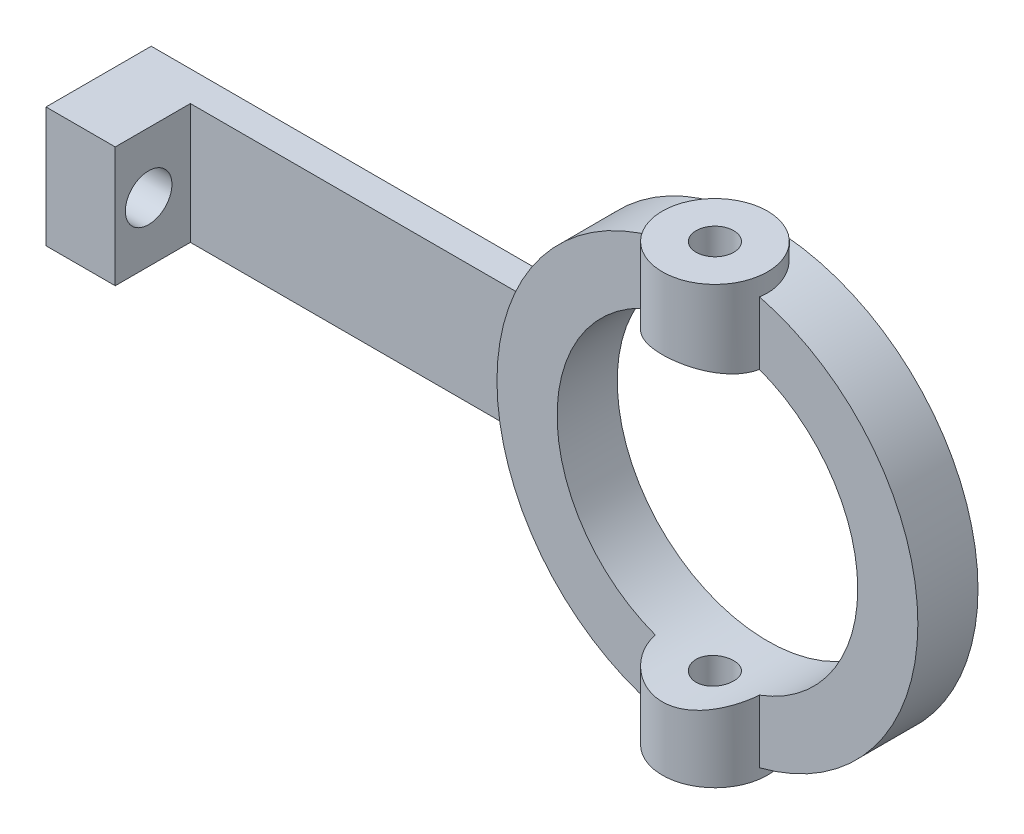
ISO-10303-21;
HEADER;
FILE_DESCRIPTION(('STEP AP214'),'2;1');
FILE_NAME('part.step','',(''),(''),'','','');
FILE_SCHEMA(('AUTOMOTIVE_DESIGN { 1 0 10303 214 1 1 1 1 }'));
ENDSEC;
DATA;
#1=APPLICATION_CONTEXT('core data for automotive mechanical design processes');
#2=APPLICATION_PROTOCOL_DEFINITION('international standard','automotive_design',2000,#1);
#3=PRODUCT_CONTEXT('',#1,'mechanical');
#4=PRODUCT('Part','Part','',(#3));
#5=PRODUCT_RELATED_PRODUCT_CATEGORY('part','',(#4));
#6=PRODUCT_DEFINITION_FORMATION('','',#4);
#7=PRODUCT_DEFINITION_CONTEXT('part definition',#1,'design');
#8=PRODUCT_DEFINITION('design','',#6,#7);
#9=PRODUCT_DEFINITION_SHAPE('','',#8);
#10=(LENGTH_UNIT() NAMED_UNIT(*) SI_UNIT(.MILLI.,.METRE.));
#11=(NAMED_UNIT(*) PLANE_ANGLE_UNIT() SI_UNIT($,.RADIAN.));
#12=(NAMED_UNIT(*) SI_UNIT($,.STERADIAN.) SOLID_ANGLE_UNIT());
#13=UNCERTAINTY_MEASURE_WITH_UNIT(LENGTH_MEASURE(1.E-05),#10,'distance_accuracy_value','');
#14=(GEOMETRIC_REPRESENTATION_CONTEXT(3) GLOBAL_UNCERTAINTY_ASSIGNED_CONTEXT((#13)) GLOBAL_UNIT_ASSIGNED_CONTEXT((#10,
#11,#12)) REPRESENTATION_CONTEXT('',''));
#15=CARTESIAN_POINT('',(0.,0.,0.));
#16=DIRECTION('',(0.,0.,1.));
#17=DIRECTION('',(1.,0.,0.));
#18=AXIS2_PLACEMENT_3D('',#15,#16,#17);
#19=CARTESIAN_POINT('',(0.,0.,2.));
#20=DIRECTION('',(0.,0.,1.));
#21=DIRECTION('',(1.,0.,0.));
#22=AXIS2_PLACEMENT_3D('',#19,#20,#21);
#23=PLANE('',#22);
#24=DIRECTION('',(-1.,0.,0.));
#25=VECTOR('',#24,1.);
#26=CARTESIAN_POINT('',(-359.861083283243,48.695652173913,2.));
#27=LINE('',#26,#25);
#28=CARTESIAN_POINT('',(-332.343049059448,48.695652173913,2.));
#29=VERTEX_POINT('',#28);
#30=CARTESIAN_POINT('',(-355.255582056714,48.695652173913,2.));
#31=VERTEX_POINT('',#30);
#32=EDGE_CURVE('E55',#29,#31,#27,.T.);
#33=ORIENTED_EDGE('',*,*,#32,.T.);
#34=DIRECTION('',(0.,1.,0.));
#35=VECTOR('',#34,1.);
#36=CARTESIAN_POINT('',(-355.255582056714,48.695652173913,2.));
#37=LINE('',#36,#35);
#38=CARTESIAN_POINT('',(-355.255582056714,40.695652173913,2.));
#39=VERTEX_POINT('',#38);
#40=EDGE_CURVE('E50',#39,#31,#37,.T.);
#41=ORIENTED_EDGE('',*,*,#40,.F.);
#42=DIRECTION('',(1.,0.,0.));
#43=VECTOR('',#42,1.);
#44=CARTESIAN_POINT('',(-359.861083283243,40.695652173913,2.));
#45=LINE('',#44,#43);
#46=CARTESIAN_POINT('',(-332.207755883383,40.695652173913,2.));
#47=VERTEX_POINT('',#46);
#48=EDGE_CURVE('E452',#39,#47,#45,.T.);
#49=ORIENTED_EDGE('',*,*,#48,.T.);
#50=CARTESIAN_POINT('',(-318.861083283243,44.9225104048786,2.));
#51=DIRECTION('',(0.,0.,1.));
#52=DIRECTION('',(1.,0.,0.));
#53=AXIS2_PLACEMENT_3D('',#50,#51,#52);
#54=CIRCLE('',#53,14.);
#55=EDGE_CURVE('E462',#29,#47,#54,.T.);
#56=ORIENTED_EDGE('',*,*,#55,.F.);
#57=EDGE_LOOP('',(#33,#41,#49,#56));
#58=FACE_BOUND('',#57,.T.);
#59=ADVANCED_FACE('F33',(#58),#23,.T.);
#60=CARTESIAN_POINT('',(-318.861083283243,59.695652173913,3.5));
#61=DIRECTION('',(0.,-1.,0.));
#62=DIRECTION('',(0.,0.,-1.));
#63=AXIS2_PLACEMENT_3D('',#60,#61,#62);
#64=CYLINDRICAL_SURFACE('',#63,3.50000000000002);
#65=CARTESIAN_POINT('',(-318.861083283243,34.9225104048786,0.));
#66=CARTESIAN_POINT('',(-319.051502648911,34.9225083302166,-2.95664941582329E-06));
#67=CARTESIAN_POINT('',(-319.241900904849,34.9279984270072,0.0155896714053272));
#68=CARTESIAN_POINT('',(-319.617056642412,34.9493558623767,0.0773337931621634));
#69=CARTESIAN_POINT('',(-319.801814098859,34.9652232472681,0.123485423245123));
#70=CARTESIAN_POINT('',(-320.160225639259,35.005619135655,0.244548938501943));
#71=CARTESIAN_POINT('',(-320.333898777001,35.0301322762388,0.31940982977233));
#72=CARTESIAN_POINT('',(-320.666219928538,35.0853414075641,0.495525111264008));
#73=CARTESIAN_POINT('',(-320.824864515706,35.1160388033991,0.596785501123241));
#74=CARTESIAN_POINT('',(-321.128609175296,35.1817042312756,0.826828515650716));
#75=CARTESIAN_POINT('',(-321.273065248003,35.2167819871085,0.956429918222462));
#76=CARTESIAN_POINT('',(-321.538695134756,35.2866764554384,1.23773666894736));
#77=CARTESIAN_POINT('',(-321.659863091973,35.3214931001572,1.38944756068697));
#78=CARTESIAN_POINT('',(-321.879312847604,35.3881568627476,1.71665464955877));
#79=CARTESIAN_POINT('',(-321.976729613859,35.4198718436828,1.89276055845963));
#80=CARTESIAN_POINT('',(-322.140282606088,35.475057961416,2.26014459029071));
#81=CARTESIAN_POINT('',(-322.20642950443,35.4985319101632,2.45141751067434));
#82=CARTESIAN_POINT('',(-322.303099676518,35.5334160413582,2.83634303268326));
#83=CARTESIAN_POINT('',(-322.334838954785,35.5452365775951,3.02965189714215));
#84=CARTESIAN_POINT('',(-322.365595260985,35.5566846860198,3.4191851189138));
#85=CARTESIAN_POINT('',(-322.364623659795,35.5563164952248,3.61540843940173));
#86=CARTESIAN_POINT('',(-322.330924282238,35.5437861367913,3.99454945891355));
#87=CARTESIAN_POINT('',(-322.299820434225,35.5322271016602,4.1776349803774));
#88=CARTESIAN_POINT('',(-322.209402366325,35.4996103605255,4.53580240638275));
#89=CARTESIAN_POINT('',(-322.15008444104,35.4785514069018,4.7108832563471));
#90=CARTESIAN_POINT('',(-322.003926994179,35.428904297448,5.05161236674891));
#91=CARTESIAN_POINT('',(-321.91662993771,35.4001924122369,5.21704555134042));
#92=CARTESIAN_POINT('',(-321.71731016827,35.3385222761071,5.53141194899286));
#93=CARTESIAN_POINT('',(-321.605279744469,35.3055627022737,5.68033999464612));
#94=CARTESIAN_POINT('',(-321.35201727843,35.2367779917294,5.9665432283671));
#95=CARTESIAN_POINT('',(-321.209469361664,35.2008974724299,6.10264324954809));
#96=CARTESIAN_POINT('',(-320.903140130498,35.1319729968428,6.34932987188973));
#97=CARTESIAN_POINT('',(-320.739356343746,35.0989293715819,6.45991349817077));
#98=CARTESIAN_POINT('',(-320.392518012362,35.0388872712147,6.65350599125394));
#99=CARTESIAN_POINT('',(-320.209257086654,35.0119655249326,6.73617056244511));
#100=CARTESIAN_POINT('',(-319.830258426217,34.9677615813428,6.86912230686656));
#101=CARTESIAN_POINT('',(-319.63452552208,34.9504756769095,6.91942193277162));
#102=CARTESIAN_POINT('',(-319.246065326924,34.9281198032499,6.98406581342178));
#103=CARTESIAN_POINT('',(-319.05363258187,34.9225115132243,6.99999580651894));
#104=CARTESIAN_POINT('',(-318.668786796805,34.9225092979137,7.00000418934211));
#105=CARTESIAN_POINT('',(-318.476373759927,34.9281132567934,6.98408858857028));
#106=CARTESIAN_POINT('',(-318.10357098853,34.9495500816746,6.92209465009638));
#107=CARTESIAN_POINT('',(-317.922993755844,34.9650440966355,6.87701486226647));
#108=CARTESIAN_POINT('',(-317.572058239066,35.0043645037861,6.75924618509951));
#109=CARTESIAN_POINT('',(-317.401701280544,35.0281919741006,6.68655372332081));
#110=CARTESIAN_POINT('',(-317.070776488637,35.0826061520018,6.51340991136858));
#111=CARTESIAN_POINT('',(-316.910610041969,35.1133616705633,6.41224601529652));
#112=CARTESIAN_POINT('',(-316.609025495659,35.1781752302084,6.18585482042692));
#113=CARTESIAN_POINT('',(-316.467613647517,35.2122343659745,6.06061953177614));
#114=CARTESIAN_POINT('',(-316.200130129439,35.2820020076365,5.782199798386));
#115=CARTESIAN_POINT('',(-316.075188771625,35.3177072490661,5.62792589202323));
#116=CARTESIAN_POINT('',(-315.852795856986,35.3850186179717,5.29985410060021));
#117=CARTESIAN_POINT('',(-315.75534526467,35.4166246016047,5.12605553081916));
#118=CARTESIAN_POINT('',(-315.590973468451,35.4719048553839,4.76333270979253));
#119=CARTESIAN_POINT('',(-315.524052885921,35.495578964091,4.57440815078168));
#120=CARTESIAN_POINT('',(-315.423331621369,35.5318349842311,4.18693454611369));
#121=CARTESIAN_POINT('',(-315.389513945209,35.5444225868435,3.98839049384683));
#122=CARTESIAN_POINT('',(-315.357363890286,35.5563897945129,3.59937967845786));
#123=CARTESIAN_POINT('',(-315.357135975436,35.5564749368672,3.40908970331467));
#124=CARTESIAN_POINT('',(-315.387432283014,35.5451971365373,3.03133737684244));
#125=CARTESIAN_POINT('',(-315.417954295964,35.5338350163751,2.84387482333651));
#126=CARTESIAN_POINT('',(-315.507486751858,35.5014934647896,2.4814490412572));
#127=CARTESIAN_POINT('',(-315.565822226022,35.4807424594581,2.30629703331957));
#128=CARTESIAN_POINT('',(-315.708762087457,35.432065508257,1.96814190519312));
#129=CARTESIAN_POINT('',(-315.79337265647,35.4041378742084,1.80514165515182));
#130=CARTESIAN_POINT('',(-315.991113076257,35.3426116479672,1.48756542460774));
#131=CARTESIAN_POINT('',(-316.105400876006,35.3088075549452,1.33375059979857));
#132=CARTESIAN_POINT('',(-316.357359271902,35.2401347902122,1.04687237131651));
#133=CARTESIAN_POINT('',(-316.495036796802,35.2052658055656,0.913815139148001));
#134=CARTESIAN_POINT('',(-316.797230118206,35.1365237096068,0.666216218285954));
#135=CARTESIAN_POINT('',(-316.962669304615,35.1027644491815,0.552765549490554));
#136=CARTESIAN_POINT('',(-317.31141565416,35.0417301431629,0.355376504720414));
#137=CARTESIAN_POINT('',(-317.494720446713,35.0144542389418,0.27143422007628));
#138=CARTESIAN_POINT('',(-317.872053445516,34.9697475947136,0.136742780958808));
#139=CARTESIAN_POINT('',(-318.06594373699,34.952213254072,0.0856433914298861));
#140=CARTESIAN_POINT('',(-318.460259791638,34.9285977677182,0.017279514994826));
#141=CARTESIAN_POINT('',(-318.660683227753,34.9225125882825,3.11161996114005E-06));
#142=CARTESIAN_POINT('',(-318.861083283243,34.9225104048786,0.));
#143=B_SPLINE_CURVE_WITH_KNOTS('',3,(#65,#66,#67,#68,#69,#70,#71,#72,#73,#74,#75,#76,#77,#78,
#79,#80,#81,#82,#83,#84,#85,#86,#87,#88,#89,#90,#91,#92,#93,#94,#95,#96,#97,#98,#99,#100,#101,
#102,#103,#104,#105,#106,#107,#108,#109,#110,#111,#112,#113,#114,#115,#116,#117,#118,#119,#120,
#121,#122,#123,#124,#125,#126,#127,#128,#129,#130,#131,#132,#133,#134,#135,#136,#137,#138,#139,
#140,#141,#142),.UNSPECIFIED.,.T.,.F.,(4,2,2,2,2,2,2,2,2,2,2,2,2,2,2,2,2,2,2,2,2,2,2,2,2,2,2,2,
2,2,2,2,2,2,2,2,2,2,4),(0.,0.570519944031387,1.14104243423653,1.71055621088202,2.28019953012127,
2.86921290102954,3.45837421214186,4.06655384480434,4.67452575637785,5.26023033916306,
5.84573132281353,6.40133800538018,6.95701767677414,7.52229238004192,8.08774356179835,
8.68595781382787,9.28424177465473,9.88965514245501,10.4948354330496,11.071437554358,
11.6479308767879,12.2056613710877,12.7634640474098,13.3367037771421,13.9101341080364,
14.5124257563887,15.1147385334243,15.7170635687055,16.319079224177,16.8871081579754,
17.4550962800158,18.0099524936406,18.5649393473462,19.1461307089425,19.7274945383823,
20.3347978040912,20.942020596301,21.5426555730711,22.1430788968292),.UNSPECIFIED.);
#144=CARTESIAN_POINT('',(-322.325184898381,35.5416788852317,4.00000000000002));
#145=VERTEX_POINT('',#144);
#146=CARTESIAN_POINT('',(-315.396981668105,35.5416788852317,4.00000000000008));
#147=VERTEX_POINT('',#146);
#148=EDGE_CURVE('E42',#145,#147,#143,.T.);
#149=ORIENTED_EDGE('',*,*,#148,.F.);
#150=DIRECTION('',(0.,-1.,0.));
#151=VECTOR('',#150,1.);
#152=CARTESIAN_POINT('',(-322.325184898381,59.695652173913,4.));
#153=LINE('',#152,#151);
#154=CARTESIAN_POINT('',(-322.325184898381,31.357850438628,4.));
#155=VERTEX_POINT('',#154);
#156=EDGE_CURVE('E446',#155,#145,#153,.F.);
#157=ORIENTED_EDGE('',*,*,#156,.F.);
#158=CARTESIAN_POINT('',(-318.861083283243,30.9225104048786,0.));
#159=CARTESIAN_POINT('',(-318.667705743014,30.9225136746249,5.42672235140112E-06));
#160=CARTESIAN_POINT('',(-318.474267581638,30.9265569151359,0.0160802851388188));
#161=CARTESIAN_POINT('',(-318.092935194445,30.9422944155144,0.0798586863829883));
#162=CARTESIAN_POINT('',(-317.905044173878,30.9539930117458,0.12758015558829));
#163=CARTESIAN_POINT('',(-317.540367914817,30.9837457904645,0.253024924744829));
#164=CARTESIAN_POINT('',(-317.36356963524,31.0017923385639,0.330712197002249));
#165=CARTESIAN_POINT('',(-317.025514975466,31.0423190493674,0.513756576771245));
#166=CARTESIAN_POINT('',(-316.864259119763,31.0647993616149,0.619114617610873));
#167=CARTESIAN_POINT('',(-316.558545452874,31.1122707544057,0.856801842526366));
#168=CARTESIAN_POINT('',(-316.414453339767,31.1373005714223,0.989593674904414));
#169=CARTESIAN_POINT('',(-316.150335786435,31.1867926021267,1.27738847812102));
#170=CARTESIAN_POINT('',(-316.030313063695,31.2112547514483,1.4323939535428));
#171=CARTESIAN_POINT('',(-315.816021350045,31.2572323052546,1.76305552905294));
#172=CARTESIAN_POINT('',(-315.722161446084,31.278698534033,1.93898420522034));
#173=CARTESIAN_POINT('',(-315.565490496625,31.3156888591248,2.30474629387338));
#174=CARTESIAN_POINT('',(-315.502674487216,31.3312139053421,2.49457747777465));
#175=CARTESIAN_POINT('',(-315.411121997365,31.354165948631,2.87873482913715));
#176=CARTESIAN_POINT('',(-315.381727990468,31.3617489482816,3.07289475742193));
#177=CARTESIAN_POINT('',(-315.355805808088,31.3684252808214,3.46352666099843));
#178=CARTESIAN_POINT('',(-315.359272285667,31.3675199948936,3.65999825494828));
#179=CARTESIAN_POINT('',(-315.398448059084,31.3574622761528,4.04463688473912));
#180=CARTESIAN_POINT('',(-315.433373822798,31.3485102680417,4.23288978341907));
#181=CARTESIAN_POINT('',(-315.533226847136,31.3236871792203,4.6007757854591));
#182=CARTESIAN_POINT('',(-315.598156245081,31.3078156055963,4.78040827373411));
#183=CARTESIAN_POINT('',(-315.756841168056,31.2707577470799,5.12805537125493));
#184=CARTESIAN_POINT('',(-315.8508810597,31.2495194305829,5.2959344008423));
#185=CARTESIAN_POINT('',(-316.064918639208,31.2041504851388,5.61381032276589));
#186=CARTESIAN_POINT('',(-316.184920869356,31.1800193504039,5.76380407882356));
#187=CARTESIAN_POINT('',(-316.45153529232,31.1307398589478,6.0461417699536));
#188=CARTESIAN_POINT('',(-316.598808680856,31.1055821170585,6.17786047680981));
#189=CARTESIAN_POINT('',(-316.913655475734,31.0577045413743,6.41484956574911));
#190=CARTESIAN_POINT('',(-317.081229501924,31.0349847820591,6.52011913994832));
#191=CARTESIAN_POINT('',(-317.43281287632,30.9944299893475,6.7014513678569));
#192=CARTESIAN_POINT('',(-317.61687669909,30.9766120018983,6.77741246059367));
#193=CARTESIAN_POINT('',(-317.99570593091,30.9479923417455,6.89714037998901));
#194=CARTESIAN_POINT('',(-318.190469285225,30.937189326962,6.94091336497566));
#195=CARTESIAN_POINT('',(-318.579823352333,30.9240154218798,6.99406765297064));
#196=CARTESIAN_POINT('',(-318.774290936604,30.9214358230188,7.00430039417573));
#197=CARTESIAN_POINT('',(-319.162159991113,30.924404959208,6.99241899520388));
#198=CARTESIAN_POINT('',(-319.355561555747,30.9299529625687,6.97030776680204));
#199=CARTESIAN_POINT('',(-319.732849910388,30.9484201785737,6.89506788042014));
#200=CARTESIAN_POINT('',(-319.916835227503,30.9612289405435,6.84240371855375));
#201=CARTESIAN_POINT('',(-320.273350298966,30.9927739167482,6.70808347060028));
#202=CARTESIAN_POINT('',(-320.445878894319,31.0115107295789,6.62642445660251));
#203=CARTESIAN_POINT('',(-320.777970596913,31.0533332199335,6.43478236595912));
#204=CARTESIAN_POINT('',(-320.937249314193,31.076490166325,6.32432240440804));
#205=CARTESIAN_POINT('',(-321.235312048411,31.1244718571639,6.07882354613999));
#206=CARTESIAN_POINT('',(-321.374092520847,31.1492968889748,5.94378040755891));
#207=CARTESIAN_POINT('',(-321.630727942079,31.1985680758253,5.64899542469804));
#208=CARTESIAN_POINT('',(-321.747985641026,31.2229899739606,5.48872869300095));
#209=CARTESIAN_POINT('',(-321.953941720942,31.2680099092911,5.1502905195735));
#210=CARTESIAN_POINT('',(-322.04264136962,31.288608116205,4.97211987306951));
#211=CARTESIAN_POINT('',(-322.18830326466,31.3234215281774,4.60388664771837));
#212=CARTESIAN_POINT('',(-322.245453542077,31.3376744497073,4.41390220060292));
#213=CARTESIAN_POINT('',(-322.32688982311,31.3582197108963,4.02661084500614));
#214=CARTESIAN_POINT('',(-322.351183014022,31.3645137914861,3.82930554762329));
#215=CARTESIAN_POINT('',(-322.365839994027,31.3682960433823,3.43905094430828));
#216=CARTESIAN_POINT('',(-322.357158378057,31.3660319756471,3.2461393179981));
#217=CARTESIAN_POINT('',(-322.308296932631,31.3535258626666,2.86462425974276));
#218=CARTESIAN_POINT('',(-322.268117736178,31.3432839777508,2.67602074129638));
#219=CARTESIAN_POINT('',(-322.157923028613,31.3161143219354,2.30951359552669));
#220=CARTESIAN_POINT('',(-322.088086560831,31.2992267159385,2.13155295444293));
#221=CARTESIAN_POINT('',(-321.920701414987,31.2606627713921,1.78974744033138));
#222=CARTESIAN_POINT('',(-321.823148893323,31.2389857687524,1.62590452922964));
#223=CARTESIAN_POINT('',(-321.600108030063,31.1925789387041,1.31237253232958));
#224=CARTESIAN_POINT('',(-321.473957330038,31.167784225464,1.16316416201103));
#225=CARTESIAN_POINT('',(-321.198591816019,31.1183231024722,0.887723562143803));
#226=CARTESIAN_POINT('',(-321.049371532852,31.0936567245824,0.761496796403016));
#227=CARTESIAN_POINT('',(-320.728840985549,31.0466984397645,0.533373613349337));
#228=CARTESIAN_POINT('',(-320.557179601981,31.0244576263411,0.43195923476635));
#229=CARTESIAN_POINT('',(-320.198704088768,30.985395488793,0.259589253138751));
#230=CARTESIAN_POINT('',(-320.011900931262,30.9685702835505,0.18861182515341));
#231=CARTESIAN_POINT('',(-319.664707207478,30.9447223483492,0.0896657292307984));
#232=CARTESIAN_POINT('',(-319.505970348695,30.9364500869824,0.0561137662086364));
#233=CARTESIAN_POINT('',(-319.185197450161,30.9253429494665,0.0112794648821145));
#234=CARTESIAN_POINT('',(-319.023161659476,30.9225076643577,-4.54837905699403E-06));
#235=CARTESIAN_POINT('',(-318.861083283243,30.9225104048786,0.));
#236=B_SPLINE_CURVE_WITH_KNOTS('',3,(#158,#159,#160,#161,#162,#163,#164,#165,#166,#167,#168,
#169,#170,#171,#172,#173,#174,#175,#176,#177,#178,#179,#180,#181,#182,#183,#184,#185,#186,#187,
#188,#189,#190,#191,#192,#193,#194,#195,#196,#197,#198,#199,#200,#201,#202,#203,#204,#205,#206,
#207,#208,#209,#210,#211,#212,#213,#214,#215,#216,#217,#218,#219,#220,#221,#222,#223,#224,#225,
#226,#227,#228,#229,#230,#231,#232,#233,#234,#235),.UNSPECIFIED.,.T.,.F.,(4,2,2,2,2,2,2,2,2,2,2,
2,2,2,2,2,2,2,2,2,2,2,2,2,2,2,2,2,2,2,2,2,2,2,2,2,2,2,4),(0.,0.579538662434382,1.15940588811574,
1.73857810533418,2.31776986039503,2.90767016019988,3.49763702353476,4.09636844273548,
4.69500409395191,5.28164688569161,5.86819422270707,6.44052493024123,7.01289641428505,
7.59104565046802,8.16929611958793,8.76403502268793,9.35879208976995,9.95559201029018,
10.5522777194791,11.1336938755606,11.7150576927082,12.2878064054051,12.860612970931,
13.4435837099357,14.0266551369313,14.624038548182,15.221395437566,15.8151526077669,
16.4087798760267,16.9853548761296,17.5619182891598,18.1350493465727,18.70825992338,
19.2964234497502,19.884726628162,20.4836843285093,21.0822118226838,21.5679856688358,
22.0537229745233),.UNSPECIFIED.);
#237=CARTESIAN_POINT('',(-318.861083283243,30.9225104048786,0.));
#238=VERTEX_POINT('',#237);
#239=EDGE_CURVE('E175',#155,#238,#236,.T.);
#240=ORIENTED_EDGE('',*,*,#239,.T.);
#241=CARTESIAN_POINT('',(-315.396981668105,31.357850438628,4.));
#242=VERTEX_POINT('',#241);
#243=EDGE_CURVE('E182',#238,#242,#236,.T.);
#244=ORIENTED_EDGE('',*,*,#243,.T.);
#245=DIRECTION('',(0.,-1.,0.));
#246=VECTOR('',#245,1.);
#247=CARTESIAN_POINT('',(-315.396981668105,59.695652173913,4.));
#248=LINE('',#247,#246);
#249=EDGE_CURVE('E445',#147,#242,#248,.T.);
#250=ORIENTED_EDGE('',*,*,#249,.F.);
#251=EDGE_LOOP('',(#149,#157,#240,#244,#250));
#252=FACE_BOUND('',#251,.T.);
#253=CARTESIAN_POINT('',(-318.861083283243,30.695652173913,3.5));
#254=DIRECTION('',(0.,-1.,0.));
#255=DIRECTION('',(0.,0.,-1.));
#256=AXIS2_PLACEMENT_3D('',#253,#254,#255);
#257=CIRCLE('',#256,3.50000000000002);
#258=CARTESIAN_POINT('',(-318.861083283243,30.695652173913,0.));
#259=VERTEX_POINT('',#258);
#260=EDGE_CURVE('E169',#259,#259,#257,.T.);
#261=ORIENTED_EDGE('',*,*,#260,.F.);
#262=EDGE_LOOP('',(#261));
#263=FACE_BOUND('',#262,.T.);
#264=ADVANCED_FACE('F199',(#252,#263),#64,.T.);
#265=CARTESIAN_POINT('',(-318.861083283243,44.9225104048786,4.));
#266=DIRECTION('',(0.,0.,-1.));
#267=DIRECTION('',(-1.,0.,0.));
#268=AXIS2_PLACEMENT_3D('',#265,#266,#267);
#269=CYLINDRICAL_SURFACE('',#268,14.);
#270=CARTESIAN_POINT('',(-318.861083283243,58.9225104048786,0.));
#271=CARTESIAN_POINT('',(-319.054460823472,58.9225071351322,5.42672235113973E-06));
#272=CARTESIAN_POINT('',(-319.247898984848,58.9184638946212,0.0160802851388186));
#273=CARTESIAN_POINT('',(-319.629231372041,58.9027263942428,0.079858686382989));
#274=CARTESIAN_POINT('',(-319.817122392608,58.8910277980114,0.127580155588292));
#275=CARTESIAN_POINT('',(-320.181798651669,58.8612750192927,0.253024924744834));
#276=CARTESIAN_POINT('',(-320.358596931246,58.8432284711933,0.33071219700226));
#277=CARTESIAN_POINT('',(-320.69665159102,58.8027017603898,0.513756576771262));
#278=CARTESIAN_POINT('',(-320.857907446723,58.7802214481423,0.619114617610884));
#279=CARTESIAN_POINT('',(-321.163621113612,58.7327500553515,0.856801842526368));
#280=CARTESIAN_POINT('',(-321.307713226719,58.7077202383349,0.989593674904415));
#281=CARTESIAN_POINT('',(-321.571830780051,58.6582282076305,1.27738847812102));
#282=CARTESIAN_POINT('',(-321.691853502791,58.6337660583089,1.4323939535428));
#283=CARTESIAN_POINT('',(-321.906145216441,58.5877885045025,1.76305552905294));
#284=CARTESIAN_POINT('',(-322.000005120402,58.5663222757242,1.93898420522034));
#285=CARTESIAN_POINT('',(-322.156676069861,58.5293319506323,2.30474629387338));
#286=CARTESIAN_POINT('',(-322.21949207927,58.513806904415,2.49457747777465));
#287=CARTESIAN_POINT('',(-322.311044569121,58.4908548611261,2.87873482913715));
#288=CARTESIAN_POINT('',(-322.340438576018,58.4832718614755,3.07289475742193));
#289=CARTESIAN_POINT('',(-322.366360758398,58.4765955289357,3.46352666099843));
#290=CARTESIAN_POINT('',(-322.362894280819,58.4775008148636,3.65999825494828));
#291=CARTESIAN_POINT('',(-322.323718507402,58.4875585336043,4.04463688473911));
#292=CARTESIAN_POINT('',(-322.288792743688,58.4965105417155,4.23288978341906));
#293=CARTESIAN_POINT('',(-322.18893971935,58.5213336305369,4.60077578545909));
#294=CARTESIAN_POINT('',(-322.124010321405,58.5372052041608,4.78040827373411));
#295=CARTESIAN_POINT('',(-321.96532539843,58.5742630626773,5.12805537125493));
#296=CARTESIAN_POINT('',(-321.871285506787,58.5955013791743,5.2959344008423));
#297=CARTESIAN_POINT('',(-321.657247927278,58.6408703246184,5.61381032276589));
#298=CARTESIAN_POINT('',(-321.53724569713,58.6650014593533,5.76380407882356));
#299=CARTESIAN_POINT('',(-321.270631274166,58.7142809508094,6.04614176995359));
#300=CARTESIAN_POINT('',(-321.12335788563,58.7394386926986,6.17786047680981));
#301=CARTESIAN_POINT('',(-320.808511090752,58.7873162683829,6.41484956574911));
#302=CARTESIAN_POINT('',(-320.640937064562,58.8100360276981,6.52011913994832));
#303=CARTESIAN_POINT('',(-320.289353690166,58.8505908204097,6.7014513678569));
#304=CARTESIAN_POINT('',(-320.105289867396,58.8684088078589,6.77741246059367));
#305=CARTESIAN_POINT('',(-319.726460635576,58.8970284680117,6.89714037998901));
#306=CARTESIAN_POINT('',(-319.531697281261,58.9078314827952,6.94091336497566));
#307=CARTESIAN_POINT('',(-319.142343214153,58.9210053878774,6.99406765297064));
#308=CARTESIAN_POINT('',(-318.947875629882,58.9235849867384,7.00430039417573));
#309=CARTESIAN_POINT('',(-318.560006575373,58.9206158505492,6.99241899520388));
#310=CARTESIAN_POINT('',(-318.366605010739,58.9150678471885,6.97030776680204));
#311=CARTESIAN_POINT('',(-317.989316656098,58.8966006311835,6.89506788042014));
#312=CARTESIAN_POINT('',(-317.805331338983,58.8837918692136,6.84240371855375));
#313=CARTESIAN_POINT('',(-317.44881626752,58.852246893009,6.70808347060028));
#314=CARTESIAN_POINT('',(-317.276287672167,58.8335100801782,6.62642445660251));
#315=CARTESIAN_POINT('',(-316.944195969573,58.7916875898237,6.43478236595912));
#316=CARTESIAN_POINT('',(-316.784917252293,58.7685306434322,6.32432240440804));
#317=CARTESIAN_POINT('',(-316.486854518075,58.7205489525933,6.07882354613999));
#318=CARTESIAN_POINT('',(-316.348074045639,58.6957239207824,5.94378040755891));
#319=CARTESIAN_POINT('',(-316.091438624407,58.6464527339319,5.64899542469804));
#320=CARTESIAN_POINT('',(-315.974180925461,58.6220308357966,5.48872869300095));
#321=CARTESIAN_POINT('',(-315.768224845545,58.5770109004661,5.1502905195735));
#322=CARTESIAN_POINT('',(-315.679525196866,58.5564126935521,4.97211987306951));
#323=CARTESIAN_POINT('',(-315.533863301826,58.5215992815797,4.60388664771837));
#324=CARTESIAN_POINT('',(-315.476713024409,58.5073463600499,4.41390220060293));
#325=CARTESIAN_POINT('',(-315.395276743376,58.4868010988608,4.02661084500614));
#326=CARTESIAN_POINT('',(-315.370983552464,58.4805070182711,3.82930554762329));
#327=CARTESIAN_POINT('',(-315.356326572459,58.4767247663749,3.43905094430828));
#328=CARTESIAN_POINT('',(-315.365008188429,58.4789888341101,3.24613931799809));
#329=CARTESIAN_POINT('',(-315.413869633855,58.4914949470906,2.86462425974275));
#330=CARTESIAN_POINT('',(-315.454048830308,58.5017368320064,2.67602074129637));
#331=CARTESIAN_POINT('',(-315.564243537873,58.5289064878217,2.30951359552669));
#332=CARTESIAN_POINT('',(-315.634080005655,58.5457940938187,2.13155295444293));
#333=CARTESIAN_POINT('',(-315.801465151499,58.5843580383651,1.78974744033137));
#334=CARTESIAN_POINT('',(-315.899017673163,58.6060350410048,1.62590452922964));
#335=CARTESIAN_POINT('',(-316.122058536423,58.6524418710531,1.31237253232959));
#336=CARTESIAN_POINT('',(-316.248209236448,58.6772365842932,1.16316416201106));
#337=CARTESIAN_POINT('',(-316.523574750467,58.726697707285,0.887723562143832));
#338=CARTESIAN_POINT('',(-316.672795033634,58.7513640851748,0.761496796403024));
#339=CARTESIAN_POINT('',(-316.993325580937,58.7983223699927,0.533373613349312));
#340=CARTESIAN_POINT('',(-317.164986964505,58.820563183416,0.431959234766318));
#341=CARTESIAN_POINT('',(-317.523462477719,58.8596253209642,0.259589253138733));
#342=CARTESIAN_POINT('',(-317.710265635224,58.8764505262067,0.188611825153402));
#343=CARTESIAN_POINT('',(-318.057459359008,58.900298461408,0.0896657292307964));
#344=CARTESIAN_POINT('',(-318.216196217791,58.9085707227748,0.056113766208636));
#345=CARTESIAN_POINT('',(-318.536969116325,58.9196778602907,0.0112794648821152));
#346=CARTESIAN_POINT('',(-318.69900490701,58.9225131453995,-4.54837905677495E-06));
#347=CARTESIAN_POINT('',(-318.861083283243,58.9225104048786,0.));
#348=B_SPLINE_CURVE_WITH_KNOTS('',3,(#270,#271,#272,#273,#274,#275,#276,#277,#278,#279,#280,
#281,#282,#283,#284,#285,#286,#287,#288,#289,#290,#291,#292,#293,#294,#295,#296,#297,#298,#299,
#300,#301,#302,#303,#304,#305,#306,#307,#308,#309,#310,#311,#312,#313,#314,#315,#316,#317,#318,
#319,#320,#321,#322,#323,#324,#325,#326,#327,#328,#329,#330,#331,#332,#333,#334,#335,#336,#337,
#338,#339,#340,#341,#342,#343,#344,#345,#346,#347),.UNSPECIFIED.,.T.,.F.,(4,2,2,2,2,2,2,2,2,2,2,
2,2,2,2,2,2,2,2,2,2,2,2,2,2,2,2,2,2,2,2,2,2,2,2,2,2,2,4),(0.,0.579538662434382,1.15940588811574,
1.73857810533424,2.31776986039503,2.90767016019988,3.49763702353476,4.09636844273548,
4.69500409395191,5.28164688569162,5.86819422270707,6.44052493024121,7.01289641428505,
7.59104565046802,8.16929611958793,8.76403502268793,9.35879208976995,9.95559201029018,
10.5522777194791,11.1336938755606,11.7150576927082,12.2878064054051,12.860612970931,
13.4435837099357,14.0266551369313,14.624038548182,15.221395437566,15.8151526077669,
16.4087798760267,16.9853548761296,17.5619182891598,18.1350493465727,18.70825992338,
19.2964234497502,19.884726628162,20.4836843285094,21.0822118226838,21.5679856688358,
22.0537229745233),.UNSPECIFIED.);
#349=CARTESIAN_POINT('',(-318.861083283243,58.9225104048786,0.));
#350=VERTEX_POINT('',#349);
#351=CARTESIAN_POINT('',(-322.325184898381,58.4871703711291,4.));
#352=VERTEX_POINT('',#351);
#353=EDGE_CURVE('E183',#350,#352,#348,.T.);
#354=ORIENTED_EDGE('',*,*,#353,.F.);
#355=CARTESIAN_POINT('',(-318.861083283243,44.9225104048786,0.));
#356=DIRECTION('',(0.,0.,-1.));
#357=DIRECTION('',(-1.,0.,0.));
#358=AXIS2_PLACEMENT_3D('',#355,#356,#357);
#359=CIRCLE('',#358,14.);
#360=CARTESIAN_POINT('',(-332.343049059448,48.695652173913,0.));
#361=VERTEX_POINT('',#360);
#362=EDGE_CURVE('E421',#361,#350,#359,.T.);
#363=ORIENTED_EDGE('',*,*,#362,.F.);
#364=DIRECTION('',(0.,0.,-1.));
#365=VECTOR('',#364,1.);
#366=CARTESIAN_POINT('',(-332.343049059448,48.695652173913,4.));
#367=LINE('',#366,#365);
#368=EDGE_CURVE('E461',#29,#361,#367,.T.);
#369=ORIENTED_EDGE('',*,*,#368,.F.);
#370=ORIENTED_EDGE('',*,*,#55,.T.);
#371=DIRECTION('',(0.,0.,-1.));
#372=VECTOR('',#371,1.);
#373=CARTESIAN_POINT('',(-332.207755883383,40.695652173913,4.));
#374=LINE('',#373,#372);
#375=CARTESIAN_POINT('',(-332.207755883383,40.695652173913,0.));
#376=VERTEX_POINT('',#375);
#377=EDGE_CURVE('E456',#376,#47,#374,.F.);
#378=ORIENTED_EDGE('',*,*,#377,.F.);
#379=EDGE_CURVE('E436',#238,#376,#359,.T.);
#380=ORIENTED_EDGE('',*,*,#379,.F.);
#381=ORIENTED_EDGE('',*,*,#239,.F.);
#382=CARTESIAN_POINT('',(-318.861083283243,44.9225104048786,4.));
#383=DIRECTION('',(0.,0.,-1.));
#384=DIRECTION('',(-1.,0.,0.));
#385=AXIS2_PLACEMENT_3D('',#382,#383,#384);
#386=CIRCLE('',#385,14.);
#387=EDGE_CURVE('E424',#155,#352,#386,.T.);
#388=ORIENTED_EDGE('',*,*,#387,.T.);
#389=EDGE_LOOP('',(#354,#363,#369,#370,#378,#380,#381,#388));
#390=FACE_BOUND('',#389,.T.);
#391=ADVANCED_FACE('F254',(#390),#269,.T.);
#392=CARTESIAN_POINT('',(-318.861083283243,44.9225104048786,4.));
#393=DIRECTION('',(0.,0.,-1.));
#394=DIRECTION('',(-1.,0.,0.));
#395=AXIS2_PLACEMENT_3D('',#392,#393,#394);
#396=PLANE('',#395);
#397=CARTESIAN_POINT('',(-315.396981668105,58.4871703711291,4.));
#398=VERTEX_POINT('',#397);
#399=CARTESIAN_POINT('',(-315.396981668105,54.3033419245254,4.));
#400=VERTEX_POINT('',#399);
#401=EDGE_CURVE('E210',#398,#400,#248,.T.);
#402=ORIENTED_EDGE('',*,*,#401,.T.);
#403=CARTESIAN_POINT('',(-318.861083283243,44.9225104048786,4.));
#404=DIRECTION('',(0.,0.,-1.));
#405=DIRECTION('',(-1.,0.,0.));
#406=AXIS2_PLACEMENT_3D('',#403,#404,#405);
#407=CIRCLE('',#406,9.99999999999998);
#408=EDGE_CURVE('E166',#400,#147,#407,.T.);
#409=ORIENTED_EDGE('',*,*,#408,.T.);
#410=ORIENTED_EDGE('',*,*,#249,.T.);
#411=EDGE_CURVE('E440',#398,#242,#386,.T.);
#412=ORIENTED_EDGE('',*,*,#411,.F.);
#413=EDGE_LOOP('',(#402,#409,#410,#412));
#414=FACE_BOUND('',#413,.T.);
#415=ADVANCED_FACE('F268',(#414),#396,.F.);
#416=CARTESIAN_POINT('',(-359.861083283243,48.695652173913,2.));
#417=DIRECTION('',(1.,0.,0.));
#418=DIRECTION('',(0.,0.,-1.));
#419=AXIS2_PLACEMENT_3D('',#416,#417,#418);
#420=PLANE('',#419);
#421=CARTESIAN_POINT('',(-359.861083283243,44.6595795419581,4.77803722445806));
#422=DIRECTION('',(-1.,0.,0.));
#423=DIRECTION('',(0.,0.,1.));
#424=AXIS2_PLACEMENT_3D('',#421,#422,#423);
#425=CIRCLE('',#424,1.55);
#426=CARTESIAN_POINT('',(-359.861083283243,44.6595795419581,6.32803722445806));
#427=VERTEX_POINT('',#426);
#428=EDGE_CURVE('E144',#427,#427,#425,.T.);
#429=ORIENTED_EDGE('',*,*,#428,.F.);
#430=EDGE_LOOP('',(#429));
#431=FACE_BOUND('',#430,.T.);
#432=DIRECTION('',(0.,-1.,0.));
#433=VECTOR('',#432,1.);
#434=CARTESIAN_POINT('',(-359.861083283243,48.695652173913,0.));
#435=LINE('',#434,#433);
#436=CARTESIAN_POINT('',(-359.861083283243,48.695652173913,0.));
#437=VERTEX_POINT('',#436);
#438=CARTESIAN_POINT('',(-359.861083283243,40.695652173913,0.));
#439=VERTEX_POINT('',#438);
#440=EDGE_CURVE('E122',#437,#439,#435,.T.);
#441=ORIENTED_EDGE('',*,*,#440,.T.);
#442=DIRECTION('',(0.,0.,-1.));
#443=VECTOR('',#442,1.);
#444=CARTESIAN_POINT('',(-359.861083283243,40.695652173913,2.));
#445=LINE('',#444,#443);
#446=CARTESIAN_POINT('',(-359.861083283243,40.695652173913,7.));
#447=VERTEX_POINT('',#446);
#448=EDGE_CURVE('E116',#447,#439,#445,.T.);
#449=ORIENTED_EDGE('',*,*,#448,.F.);
#450=DIRECTION('',(0.,-1.,0.));
#451=VECTOR('',#450,1.);
#452=CARTESIAN_POINT('',(-359.861083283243,48.695652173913,7.));
#453=LINE('',#452,#451);
#454=CARTESIAN_POINT('',(-359.861083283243,48.695652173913,7.));
#455=VERTEX_POINT('',#454);
#456=EDGE_CURVE('E120',#455,#447,#453,.T.);
#457=ORIENTED_EDGE('',*,*,#456,.F.);
#458=DIRECTION('',(0.,0.,-1.));
#459=VECTOR('',#458,1.);
#460=CARTESIAN_POINT('',(-359.861083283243,48.695652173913,2.));
#461=LINE('',#460,#459);
#462=EDGE_CURVE('E126',#455,#437,#461,.T.);
#463=ORIENTED_EDGE('',*,*,#462,.T.);
#464=EDGE_LOOP('',(#441,#449,#457,#463));
#465=FACE_BOUND('',#464,.T.);
#466=ADVANCED_FACE('F35',(#431,#465),#420,.F.);
#467=CARTESIAN_POINT('',(-359.861083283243,40.695652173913,2.));
#468=DIRECTION('',(0.,1.,0.));
#469=DIRECTION('',(0.,0.,1.));
#470=AXIS2_PLACEMENT_3D('',#467,#468,#469);
#471=PLANE('',#470);
#472=DIRECTION('',(1.,0.,0.));
#473=VECTOR('',#472,1.);
#474=CARTESIAN_POINT('',(-359.861083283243,40.695652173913,0.));
#475=LINE('',#474,#473);
#476=EDGE_CURVE('E453',#439,#376,#475,.T.);
#477=ORIENTED_EDGE('',*,*,#476,.T.);
#478=ORIENTED_EDGE('',*,*,#377,.T.);
#479=ORIENTED_EDGE('',*,*,#48,.F.);
#480=DIRECTION('',(0.,0.,-1.));
#481=VECTOR('',#480,1.);
#482=CARTESIAN_POINT('',(-355.255582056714,40.695652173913,7.));
#483=LINE('',#482,#481);
#484=CARTESIAN_POINT('',(-355.255582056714,40.695652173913,7.));
#485=VERTEX_POINT('',#484);
#486=EDGE_CURVE('E132',#485,#39,#483,.T.);
#487=ORIENTED_EDGE('',*,*,#486,.F.);
#488=DIRECTION('',(1.,0.,0.));
#489=VECTOR('',#488,1.);
#490=CARTESIAN_POINT('',(-359.861083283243,40.695652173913,7.));
#491=LINE('',#490,#489);
#492=EDGE_CURVE('E129',#447,#485,#491,.T.);
#493=ORIENTED_EDGE('',*,*,#492,.F.);
#494=ORIENTED_EDGE('',*,*,#448,.T.);
#495=EDGE_LOOP('',(#477,#478,#479,#487,#493,#494));
#496=FACE_BOUND('',#495,.T.);
#497=ADVANCED_FACE('F130',(#496),#471,.F.);
#498=CARTESIAN_POINT('',(-359.861083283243,48.695652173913,2.));
#499=DIRECTION('',(0.,-1.,0.));
#500=DIRECTION('',(0.,0.,-1.));
#501=AXIS2_PLACEMENT_3D('',#498,#499,#500);
#502=PLANE('',#501);
#503=ORIENTED_EDGE('',*,*,#32,.F.);
#504=ORIENTED_EDGE('',*,*,#368,.T.);
#505=DIRECTION('',(-1.,0.,0.));
#506=VECTOR('',#505,1.);
#507=CARTESIAN_POINT('',(-359.861083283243,48.695652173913,0.));
#508=LINE('',#507,#506);
#509=EDGE_CURVE('E439',#361,#437,#508,.T.);
#510=ORIENTED_EDGE('',*,*,#509,.T.);
#511=ORIENTED_EDGE('',*,*,#462,.F.);
#512=DIRECTION('',(-1.,0.,0.));
#513=VECTOR('',#512,1.);
#514=CARTESIAN_POINT('',(-359.861083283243,48.695652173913,7.));
#515=LINE('',#514,#513);
#516=CARTESIAN_POINT('',(-355.255582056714,48.695652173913,7.));
#517=VERTEX_POINT('',#516);
#518=EDGE_CURVE('E140',#517,#455,#515,.T.);
#519=ORIENTED_EDGE('',*,*,#518,.F.);
#520=DIRECTION('',(0.,0.,-1.));
#521=VECTOR('',#520,1.);
#522=CARTESIAN_POINT('',(-355.255582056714,48.695652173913,7.));
#523=LINE('',#522,#521);
#524=EDGE_CURVE('E147',#517,#31,#523,.T.);
#525=ORIENTED_EDGE('',*,*,#524,.T.);
#526=EDGE_LOOP('',(#503,#504,#510,#511,#519,#525));
#527=FACE_BOUND('',#526,.T.);
#528=ADVANCED_FACE('F260',(#527),#502,.F.);
#529=CARTESIAN_POINT('',(0.,0.,0.));
#530=DIRECTION('',(0.,0.,1.));
#531=DIRECTION('',(1.,0.,0.));
#532=AXIS2_PLACEMENT_3D('',#529,#530,#531);
#533=PLANE('',#532);
#534=CARTESIAN_POINT('',(-318.861083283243,44.9225104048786,0.));
#535=DIRECTION('',(0.,0.,1.));
#536=DIRECTION('',(1.,0.,0.));
#537=AXIS2_PLACEMENT_3D('',#534,#535,#536);
#538=CIRCLE('',#537,9.99999999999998);
#539=CARTESIAN_POINT('',(-308.861083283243,44.9225104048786,0.));
#540=VERTEX_POINT('',#539);
#541=EDGE_CURVE('E159',#540,#540,#538,.T.);
#542=ORIENTED_EDGE('',*,*,#541,.T.);
#543=EDGE_LOOP('',(#542));
#544=FACE_BOUND('',#543,.T.);
#545=ORIENTED_EDGE('',*,*,#362,.T.);
#546=EDGE_CURVE('E430',#350,#238,#359,.T.);
#547=ORIENTED_EDGE('',*,*,#546,.T.);
#548=ORIENTED_EDGE('',*,*,#379,.T.);
#549=ORIENTED_EDGE('',*,*,#476,.F.);
#550=ORIENTED_EDGE('',*,*,#440,.F.);
#551=ORIENTED_EDGE('',*,*,#509,.F.);
#552=EDGE_LOOP('',(#545,#547,#548,#549,#550,#551));
#553=FACE_BOUND('',#552,.T.);
#554=ADVANCED_FACE('F257',(#544,#553),#533,.F.);
#555=EDGE_CURVE('E426',#398,#350,#348,.T.);
#556=ORIENTED_EDGE('',*,*,#555,.F.);
#557=ORIENTED_EDGE('',*,*,#411,.T.);
#558=ORIENTED_EDGE('',*,*,#243,.F.);
#559=ORIENTED_EDGE('',*,*,#546,.F.);
#560=EDGE_LOOP('',(#556,#557,#558,#559));
#561=FACE_BOUND('',#560,.T.);
#562=ADVANCED_FACE('F188',(#561),#269,.T.);
#563=ORIENTED_EDGE('',*,*,#156,.T.);
#564=CARTESIAN_POINT('',(-318.861083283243,44.9225104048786,4.));
#565=DIRECTION('',(0.,0.,-1.));
#566=DIRECTION('',(-1.,0.,0.));
#567=AXIS2_PLACEMENT_3D('',#564,#565,#566);
#568=CIRCLE('',#567,9.99999999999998);
#569=CARTESIAN_POINT('',(-322.325184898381,54.3033419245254,4.));
#570=VERTEX_POINT('',#569);
#571=EDGE_CURVE('E163',#145,#570,#568,.T.);
#572=ORIENTED_EDGE('',*,*,#571,.T.);
#573=EDGE_CURVE('E125',#570,#352,#153,.F.);
#574=ORIENTED_EDGE('',*,*,#573,.T.);
#575=ORIENTED_EDGE('',*,*,#387,.F.);
#576=EDGE_LOOP('',(#563,#572,#574,#575));
#577=FACE_BOUND('',#576,.T.);
#578=ADVANCED_FACE('F197',(#577),#396,.F.);
#579=CARTESIAN_POINT('',(-318.861083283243,54.9225104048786,0.));
#580=CARTESIAN_POINT('',(-318.670663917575,54.9225124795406,-2.95664941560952E-06));
#581=CARTESIAN_POINT('',(-318.480265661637,54.91702238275,0.0155896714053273));
#582=CARTESIAN_POINT('',(-318.105109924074,54.8956649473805,0.0773337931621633));
#583=CARTESIAN_POINT('',(-317.920352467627,54.8797975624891,0.123485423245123));
#584=CARTESIAN_POINT('',(-317.561940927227,54.8394016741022,0.244548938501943));
#585=CARTESIAN_POINT('',(-317.388267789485,54.8148885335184,0.31940982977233));
#586=CARTESIAN_POINT('',(-317.055946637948,54.7596794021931,0.495525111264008));
#587=CARTESIAN_POINT('',(-316.89730205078,54.7289820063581,0.59678550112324));
#588=CARTESIAN_POINT('',(-316.59355739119,54.6633165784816,0.826828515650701));
#589=CARTESIAN_POINT('',(-316.449101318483,54.6282388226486,0.95642991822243));
#590=CARTESIAN_POINT('',(-316.18347143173,54.5583443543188,1.23773666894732));
#591=CARTESIAN_POINT('',(-316.062303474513,54.5235277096,1.38944756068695));
#592=CARTESIAN_POINT('',(-315.842853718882,54.4568639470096,1.71665464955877));
#593=CARTESIAN_POINT('',(-315.745436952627,54.4251489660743,1.89276055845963));
#594=CARTESIAN_POINT('',(-315.581883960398,54.3699628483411,2.26014459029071));
#595=CARTESIAN_POINT('',(-315.515737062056,54.346488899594,2.45141751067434));
#596=CARTESIAN_POINT('',(-315.419066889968,54.311604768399,2.83634303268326));
#597=CARTESIAN_POINT('',(-315.387327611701,54.299784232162,3.02965189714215));
#598=CARTESIAN_POINT('',(-315.356571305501,54.2883361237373,3.4191851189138));
#599=CARTESIAN_POINT('',(-315.357542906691,54.2887043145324,3.61540843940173));
#600=CARTESIAN_POINT('',(-315.391242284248,54.3012346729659,3.99454945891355));
#601=CARTESIAN_POINT('',(-315.422346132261,54.312793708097,4.1776349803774));
#602=CARTESIAN_POINT('',(-315.512764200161,54.3454104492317,4.53580240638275));
#603=CARTESIAN_POINT('',(-315.572082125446,54.3664694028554,4.7108832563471));
#604=CARTESIAN_POINT('',(-315.718239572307,54.4161165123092,5.05161236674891));
#605=CARTESIAN_POINT('',(-315.805536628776,54.4448283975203,5.21704555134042));
#606=CARTESIAN_POINT('',(-316.004856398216,54.5064985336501,5.53141194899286));
#607=CARTESIAN_POINT('',(-316.116886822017,54.5394581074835,5.68033999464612));
#608=CARTESIAN_POINT('',(-316.370149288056,54.6082428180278,5.9665432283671));
#609=CARTESIAN_POINT('',(-316.512697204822,54.6441233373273,6.10264324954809));
#610=CARTESIAN_POINT('',(-316.819026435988,54.7130478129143,6.34932987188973));
#611=CARTESIAN_POINT('',(-316.98281022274,54.7460914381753,6.45991349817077));
#612=CARTESIAN_POINT('',(-317.329648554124,54.8061335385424,6.65350599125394));
#613=CARTESIAN_POINT('',(-317.512909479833,54.8330552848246,6.73617056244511));
#614=CARTESIAN_POINT('',(-317.891908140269,54.8772592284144,6.86912230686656));
#615=CARTESIAN_POINT('',(-318.087641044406,54.8945451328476,6.91942193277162));
#616=CARTESIAN_POINT('',(-318.476101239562,54.9169010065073,6.98406581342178));
#617=CARTESIAN_POINT('',(-318.668533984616,54.9225092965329,6.99999580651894));
#618=CARTESIAN_POINT('',(-319.053379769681,54.9225115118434,7.00000418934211));
#619=CARTESIAN_POINT('',(-319.245792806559,54.9169075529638,6.98408858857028));
#620=CARTESIAN_POINT('',(-319.618595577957,54.8954707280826,6.92209465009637));
#621=CARTESIAN_POINT('',(-319.799172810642,54.8799767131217,6.87701486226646));
#622=CARTESIAN_POINT('',(-320.15010832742,54.8406563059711,6.7592461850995));
#623=CARTESIAN_POINT('',(-320.320465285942,54.8168288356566,6.6865537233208));
#624=CARTESIAN_POINT('',(-320.651390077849,54.7624146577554,6.51340991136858));
#625=CARTESIAN_POINT('',(-320.811556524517,54.7316591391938,6.41224601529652));
#626=CARTESIAN_POINT('',(-321.113141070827,54.6668455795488,6.18585482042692));
#627=CARTESIAN_POINT('',(-321.254552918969,54.6327864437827,6.06061953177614));
#628=CARTESIAN_POINT('',(-321.522036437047,54.5630188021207,5.782199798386));
#629=CARTESIAN_POINT('',(-321.646977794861,54.527313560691,5.62792589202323));
#630=CARTESIAN_POINT('',(-321.8693707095,54.4600021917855,5.29985410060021));
#631=CARTESIAN_POINT('',(-321.966821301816,54.4283962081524,5.12605553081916));
#632=CARTESIAN_POINT('',(-322.131193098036,54.3731159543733,4.76333270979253));
#633=CARTESIAN_POINT('',(-322.198113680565,54.3494418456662,4.57440815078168));
#634=CARTESIAN_POINT('',(-322.298834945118,54.3131858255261,4.18693454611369));
#635=CARTESIAN_POINT('',(-322.332652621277,54.3005982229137,3.98839049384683));
#636=CARTESIAN_POINT('',(-322.3648026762,54.2886310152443,3.59937967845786));
#637=CARTESIAN_POINT('',(-322.36503059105,54.28854587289,3.40908970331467));
#638=CARTESIAN_POINT('',(-322.334734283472,54.2998236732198,3.03133737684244));
#639=CARTESIAN_POINT('',(-322.304212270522,54.3111857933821,2.84387482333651));
#640=CARTESIAN_POINT('',(-322.214679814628,54.3435273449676,2.4814490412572));
#641=CARTESIAN_POINT('',(-322.156344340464,54.364278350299,2.30629703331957));
#642=CARTESIAN_POINT('',(-322.013404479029,54.4129553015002,1.96814190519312));
#643=CARTESIAN_POINT('',(-321.928793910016,54.4408829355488,1.80514165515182));
#644=CARTESIAN_POINT('',(-321.731053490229,54.50240916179,1.48756542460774));
#645=CARTESIAN_POINT('',(-321.61676569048,54.536213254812,1.33375059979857));
#646=CARTESIAN_POINT('',(-321.364807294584,54.604886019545,1.04687237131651));
#647=CARTESIAN_POINT('',(-321.227129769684,54.6397550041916,0.913815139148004));
#648=CARTESIAN_POINT('',(-320.92493644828,54.7084971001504,0.666216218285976));
#649=CARTESIAN_POINT('',(-320.759497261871,54.7422563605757,0.552765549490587));
#650=CARTESIAN_POINT('',(-320.410750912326,54.8032906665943,0.355376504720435));
#651=CARTESIAN_POINT('',(-320.227446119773,54.8305665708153,0.27143422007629));
#652=CARTESIAN_POINT('',(-319.85011312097,54.8752732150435,0.136742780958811));
#653=CARTESIAN_POINT('',(-319.656222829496,54.8928075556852,0.085643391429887));
#654=CARTESIAN_POINT('',(-319.261906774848,54.916423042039,0.0172795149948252));
#655=CARTESIAN_POINT('',(-319.061483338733,54.9225082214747,3.11161996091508E-06));
#656=CARTESIAN_POINT('',(-318.861083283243,54.9225104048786,0.));
#657=B_SPLINE_CURVE_WITH_KNOTS('',3,(#579,#580,#581,#582,#583,#584,#585,#586,#587,#588,#589,
#590,#591,#592,#593,#594,#595,#596,#597,#598,#599,#600,#601,#602,#603,#604,#605,#606,#607,#608,
#609,#610,#611,#612,#613,#614,#615,#616,#617,#618,#619,#620,#621,#622,#623,#624,#625,#626,#627,
#628,#629,#630,#631,#632,#633,#634,#635,#636,#637,#638,#639,#640,#641,#642,#643,#644,#645,#646,
#647,#648,#649,#650,#651,#652,#653,#654,#655,#656),.UNSPECIFIED.,.T.,.F.,(4,2,2,2,2,2,2,2,2,2,2,
2,2,2,2,2,2,2,2,2,2,2,2,2,2,2,2,2,2,2,2,2,2,2,2,2,2,2,4),(0.,0.570519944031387,1.14104243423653,
1.71055621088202,2.28019953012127,2.86921290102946,3.45837421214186,4.06655384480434,
4.67452575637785,5.26023033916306,5.84573132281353,6.40133800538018,6.95701767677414,
7.52229238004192,8.08774356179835,8.68595781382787,9.28424177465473,9.88965514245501,
10.4948354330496,11.071437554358,11.6479308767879,12.2056613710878,12.7634640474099,
13.3367037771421,13.9101341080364,14.5124257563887,15.1147385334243,15.7170635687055,
16.319079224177,16.8871081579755,17.4550962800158,18.0099524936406,18.5649393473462,
19.1461307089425,19.7274945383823,20.3347978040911,20.942020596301,21.5426555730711,
22.1430788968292),.UNSPECIFIED.);
#658=EDGE_CURVE('E11',#400,#570,#657,.T.);
#659=ORIENTED_EDGE('',*,*,#658,.F.);
#660=ORIENTED_EDGE('',*,*,#401,.F.);
#661=ORIENTED_EDGE('',*,*,#555,.T.);
#662=ORIENTED_EDGE('',*,*,#353,.T.);
#663=ORIENTED_EDGE('',*,*,#573,.F.);
#664=EDGE_LOOP('',(#659,#660,#661,#662,#663));
#665=FACE_BOUND('',#664,.T.);
#666=CARTESIAN_POINT('',(-318.861083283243,59.695652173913,3.5));
#667=DIRECTION('',(0.,-1.,0.));
#668=DIRECTION('',(0.,0.,-1.));
#669=AXIS2_PLACEMENT_3D('',#666,#667,#668);
#670=CIRCLE('',#669,3.50000000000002);
#671=CARTESIAN_POINT('',(-318.861083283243,59.695652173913,0.));
#672=VERTEX_POINT('',#671);
#673=EDGE_CURVE('E172',#672,#672,#670,.T.);
#674=ORIENTED_EDGE('',*,*,#673,.T.);
#675=EDGE_LOOP('',(#674));
#676=FACE_BOUND('',#675,.T.);
#677=ADVANCED_FACE('F192',(#665,#676),#64,.T.);
#678=CARTESIAN_POINT('',(-318.861083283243,59.695652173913,3.5));
#679=DIRECTION('',(0.,-1.,0.));
#680=DIRECTION('',(0.,0.,-1.));
#681=AXIS2_PLACEMENT_3D('',#678,#679,#680);
#682=PLANE('',#681);
#683=CARTESIAN_POINT('',(-318.861083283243,59.695652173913,3.5));
#684=DIRECTION('',(0.,-1.,0.));
#685=DIRECTION('',(0.,0.,-1.));
#686=AXIS2_PLACEMENT_3D('',#683,#684,#685);
#687=CIRCLE('',#686,1.24999999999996);
#688=CARTESIAN_POINT('',(-318.861083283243,59.695652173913,2.25000000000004));
#689=VERTEX_POINT('',#688);
#690=EDGE_CURVE('E152',#689,#689,#687,.T.);
#691=ORIENTED_EDGE('',*,*,#690,.T.);
#692=EDGE_LOOP('',(#691));
#693=FACE_BOUND('',#692,.T.);
#694=ORIENTED_EDGE('',*,*,#673,.F.);
#695=EDGE_LOOP('',(#694));
#696=FACE_BOUND('',#695,.T.);
#697=ADVANCED_FACE('F196',(#693,#696),#682,.F.);
#698=CARTESIAN_POINT('',(-318.861083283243,30.695652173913,3.5));
#699=DIRECTION('',(0.,-1.,0.));
#700=DIRECTION('',(0.,0.,-1.));
#701=AXIS2_PLACEMENT_3D('',#698,#699,#700);
#702=PLANE('',#701);
#703=CARTESIAN_POINT('',(-318.861083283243,30.695652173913,3.5));
#704=DIRECTION('',(0.,-1.,0.));
#705=DIRECTION('',(0.,0.,-1.));
#706=AXIS2_PLACEMENT_3D('',#703,#704,#705);
#707=CIRCLE('',#706,1.24999999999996);
#708=CARTESIAN_POINT('',(-318.861083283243,30.695652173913,2.25000000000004));
#709=VERTEX_POINT('',#708);
#710=EDGE_CURVE('E156',#709,#709,#707,.T.);
#711=ORIENTED_EDGE('',*,*,#710,.F.);
#712=EDGE_LOOP('',(#711));
#713=FACE_BOUND('',#712,.T.);
#714=ORIENTED_EDGE('',*,*,#260,.T.);
#715=EDGE_LOOP('',(#714));
#716=FACE_BOUND('',#715,.T.);
#717=ADVANCED_FACE('F221',(#713,#716),#702,.T.);
#718=CARTESIAN_POINT('',(-318.861083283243,44.9225104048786,0.));
#719=DIRECTION('',(0.,0.,1.));
#720=DIRECTION('',(1.,0.,0.));
#721=AXIS2_PLACEMENT_3D('',#718,#719,#720);
#722=CYLINDRICAL_SURFACE('',#721,9.99999999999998);
#723=CARTESIAN_POINT('',(-318.861083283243,54.9225104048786,2.25000000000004));
#724=CARTESIAN_POINT('',(-318.931003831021,54.9225094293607,2.2500029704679));
#725=CARTESIAN_POINT('',(-319.000968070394,54.9217693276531,2.25588643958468));
#726=CARTESIAN_POINT('',(-319.138949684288,54.9188881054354,2.27926387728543));
#727=CARTESIAN_POINT('',(-319.206964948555,54.9167455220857,2.29676996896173));
#728=CARTESIAN_POINT('',(-319.33903107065,54.9113007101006,2.34286882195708));
#729=CARTESIAN_POINT('',(-319.403084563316,54.9079992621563,2.37145412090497));
#730=CARTESIAN_POINT('',(-319.52547302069,54.9006039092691,2.43888364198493));
#731=CARTESIAN_POINT('',(-319.583808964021,54.8965101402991,2.47772610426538));
#732=CARTESIAN_POINT('',(-319.693439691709,54.8879620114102,2.5647959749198));
#733=CARTESIAN_POINT('',(-319.744698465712,54.8835059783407,2.61306856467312));
#734=CARTESIAN_POINT('',(-319.838409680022,54.8747490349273,2.71753141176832));
#735=CARTESIAN_POINT('',(-319.880861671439,54.8704481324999,2.77372207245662));
#736=CARTESIAN_POINT('',(-319.955888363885,54.8624719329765,2.89265998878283));
#737=CARTESIAN_POINT('',(-319.988429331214,54.8587987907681,2.95542868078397));
#738=CARTESIAN_POINT('',(-320.042494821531,54.852516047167,3.08559352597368));
#739=CARTESIAN_POINT('',(-320.064019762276,54.8499064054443,3.15298950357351));
#740=CARTESIAN_POINT('',(-320.095332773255,54.8460621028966,3.29012209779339));
#741=CARTESIAN_POINT('',(-320.105181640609,54.8448203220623,3.3598446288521));
#742=CARTESIAN_POINT('',(-320.113051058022,54.8438305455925,3.49996313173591));
#743=CARTESIAN_POINT('',(-320.111072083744,54.8440824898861,3.57035907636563));
#744=CARTESIAN_POINT('',(-320.095391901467,54.8460451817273,3.70940241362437));
#745=CARTESIAN_POINT('',(-320.081757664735,54.8477475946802,3.77805749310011));
#746=CARTESIAN_POINT('',(-320.043258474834,54.8524064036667,3.91209751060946));
#747=CARTESIAN_POINT('',(-320.018393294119,54.8553628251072,3.97748238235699));
#748=CARTESIAN_POINT('',(-319.958066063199,54.8622059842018,4.1033339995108));
#749=CARTESIAN_POINT('',(-319.922574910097,54.8660952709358,4.16378665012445));
#750=CARTESIAN_POINT('',(-319.842024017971,54.8743639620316,4.27790334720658));
#751=CARTESIAN_POINT('',(-319.796963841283,54.8787433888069,4.3315670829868));
#752=CARTESIAN_POINT('',(-319.69818283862,54.8875359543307,4.43097135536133));
#753=CARTESIAN_POINT('',(-319.644404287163,54.891949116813,4.47665454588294));
#754=CARTESIAN_POINT('',(-319.5299118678,54.9002835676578,4.55835444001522));
#755=CARTESIAN_POINT('',(-319.469197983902,54.9042048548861,4.59437112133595));
#756=CARTESIAN_POINT('',(-319.342514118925,54.9111161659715,4.65571566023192));
#757=CARTESIAN_POINT('',(-319.276542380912,54.9141058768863,4.68103992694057));
#758=CARTESIAN_POINT('',(-319.141237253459,54.9188143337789,4.72023524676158));
#759=CARTESIAN_POINT('',(-319.071904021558,54.9205331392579,4.73410683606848));
#760=CARTESIAN_POINT('',(-318.9323398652,54.9224983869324,4.74992871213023));
#761=CARTESIAN_POINT('',(-318.862118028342,54.9227545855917,4.75195799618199));
#762=CARTESIAN_POINT('',(-318.722335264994,54.9217920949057,4.74424613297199));
#763=CARTESIAN_POINT('',(-318.652774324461,54.9205734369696,4.73450523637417));
#764=CARTESIAN_POINT('',(-318.516521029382,54.916804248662,4.70359514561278));
#765=CARTESIAN_POINT('',(-318.449819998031,54.9142581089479,4.68246361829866));
#766=CARTESIAN_POINT('',(-318.320908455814,54.9081190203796,4.62941127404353));
#767=CARTESIAN_POINT('',(-318.25869809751,54.9045260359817,4.59749009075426));
#768=CARTESIAN_POINT('',(-318.140181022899,54.8966695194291,4.52357343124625));
#769=CARTESIAN_POINT('',(-318.083906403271,54.8924026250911,4.48152685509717));
#770=CARTESIAN_POINT('',(-317.97918478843,54.8836861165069,4.3886252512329));
#771=CARTESIAN_POINT('',(-317.930738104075,54.8792364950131,4.33776987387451));
#772=CARTESIAN_POINT('',(-317.842767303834,54.8706259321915,4.22834629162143));
#773=CARTESIAN_POINT('',(-317.803295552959,54.8664667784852,4.1697358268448));
#774=CARTESIAN_POINT('',(-317.734756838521,54.8589374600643,4.04667087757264));
#775=CARTESIAN_POINT('',(-317.705689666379,54.8555672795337,3.98221651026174));
#776=CARTESIAN_POINT('',(-317.65886999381,54.8500096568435,3.8494623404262));
#777=CARTESIAN_POINT('',(-317.641087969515,54.8478191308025,3.78117308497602));
#778=CARTESIAN_POINT('',(-317.617248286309,54.8448599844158,3.64254875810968));
#779=CARTESIAN_POINT('',(-317.611190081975,54.8440912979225,3.57221378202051));
#780=CARTESIAN_POINT('',(-317.610980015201,54.8440647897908,3.43201553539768));
#781=CARTESIAN_POINT('',(-317.616745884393,54.8447965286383,3.36215237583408));
#782=CARTESIAN_POINT('',(-317.639846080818,54.8476659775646,3.22439643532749));
#783=CARTESIAN_POINT('',(-317.65718040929,54.849803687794,3.15650365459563));
#784=CARTESIAN_POINT('',(-317.702899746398,54.8552409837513,3.02462652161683));
#785=CARTESIAN_POINT('',(-317.731280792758,54.8585401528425,2.96064077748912));
#786=CARTESIAN_POINT('',(-317.798279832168,54.8659293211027,2.83832667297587));
#787=CARTESIAN_POINT('',(-317.836897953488,54.8700193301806,2.77999838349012));
#788=CARTESIAN_POINT('',(-317.92358011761,54.8785634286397,2.6702343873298));
#789=CARTESIAN_POINT('',(-317.971705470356,54.8830197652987,2.61884726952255));
#790=CARTESIAN_POINT('',(-318.075908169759,54.8917745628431,2.52484658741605));
#791=CARTESIAN_POINT('',(-318.131987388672,54.8960729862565,2.48223509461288));
#792=CARTESIAN_POINT('',(-318.250750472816,54.9040456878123,2.4068573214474));
#793=CARTESIAN_POINT('',(-318.313458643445,54.9077175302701,2.37412909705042));
#794=CARTESIAN_POINT('',(-318.443491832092,54.9139986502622,2.3197143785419));
#795=CARTESIAN_POINT('',(-318.510811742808,54.9166090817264,2.29801588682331));
#796=CARTESIAN_POINT('',(-318.625580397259,54.9198440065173,2.27147033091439));
#797=CARTESIAN_POINT('',(-318.672305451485,54.9208390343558,2.26343052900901));
#798=CARTESIAN_POINT('',(-318.766374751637,54.9221725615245,2.25269437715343));
#799=CARTESIAN_POINT('',(-318.813718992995,54.9225110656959,2.24999798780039));
#800=CARTESIAN_POINT('',(-318.861083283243,54.9225104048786,2.25000000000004));
#801=B_SPLINE_CURVE_WITH_KNOTS('',3,(#723,#724,#725,#726,#727,#728,#729,#730,#731,#732,#733,
#734,#735,#736,#737,#738,#739,#740,#741,#742,#743,#744,#745,#746,#747,#748,#749,#750,#751,#752,
#753,#754,#755,#756,#757,#758,#759,#760,#761,#762,#763,#764,#765,#766,#767,#768,#769,#770,#771,
#772,#773,#774,#775,#776,#777,#778,#779,#780,#781,#782,#783,#784,#785,#786,#787,#788,#789,#790,
#791,#792,#793,#794,#795,#796,#797,#798,#799,#800),.UNSPECIFIED.,.T.,.F.,(4,2,2,2,2,2,2,2,2,2,2,
2,2,2,2,2,2,2,2,2,2,2,2,2,2,2,2,2,2,2,2,2,2,2,2,2,2,2,4),(0.,0.209588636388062,
0.419396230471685,0.629062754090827,0.838693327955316,1.04935406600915,1.26002553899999,
1.47140625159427,1.68277894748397,1.89304612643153,2.10330484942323,2.31236348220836,
2.52142635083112,2.73106713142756,2.94071750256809,3.15181739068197,3.36291776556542,
3.57408897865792,3.78525030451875,3.99500139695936,4.20474802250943,4.41380526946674,
4.62286961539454,4.83301201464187,5.04316275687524,5.25450985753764,5.46585272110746,
5.67664037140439,5.88741821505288,6.09673450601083,6.30605081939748,6.51529212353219,
6.72453604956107,6.93517618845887,7.14586599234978,7.35735701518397,7.56861749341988,
7.71059421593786,7.8525698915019),.UNSPECIFIED.);
#802=CARTESIAN_POINT('',(-318.861083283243,54.9225104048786,2.25000000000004));
#803=VERTEX_POINT('',#802);
#804=EDGE_CURVE('E160',#803,#803,#801,.T.);
#805=ORIENTED_EDGE('',*,*,#804,.T.);
#806=EDGE_LOOP('',(#805));
#807=FACE_BOUND('',#806,.T.);
#808=CARTESIAN_POINT('',(-318.861083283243,34.9225104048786,2.25000000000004));
#809=CARTESIAN_POINT('',(-318.791162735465,34.9225113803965,2.2500029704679));
#810=CARTESIAN_POINT('',(-318.721198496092,34.9232514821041,2.25588643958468));
#811=CARTESIAN_POINT('',(-318.583216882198,34.9261327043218,2.27926387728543));
#812=CARTESIAN_POINT('',(-318.515201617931,34.9282752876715,2.29676996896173));
#813=CARTESIAN_POINT('',(-318.383135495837,34.9337200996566,2.34286882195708));
#814=CARTESIAN_POINT('',(-318.31908200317,34.9370215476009,2.37145412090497));
#815=CARTESIAN_POINT('',(-318.196693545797,34.9444169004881,2.43888364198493));
#816=CARTESIAN_POINT('',(-318.138357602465,34.948510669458,2.47772610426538));
#817=CARTESIAN_POINT('',(-318.028726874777,34.957058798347,2.5647959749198));
#818=CARTESIAN_POINT('',(-317.977468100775,34.9615148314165,2.61306856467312));
#819=CARTESIAN_POINT('',(-317.883756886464,34.9702717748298,2.71753141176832));
#820=CARTESIAN_POINT('',(-317.841304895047,34.9745726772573,2.77372207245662));
#821=CARTESIAN_POINT('',(-317.766278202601,34.9825488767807,2.89265998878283));
#822=CARTESIAN_POINT('',(-317.733737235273,34.9862220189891,2.95542868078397));
#823=CARTESIAN_POINT('',(-317.679671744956,34.9925047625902,3.08559352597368));
#824=CARTESIAN_POINT('',(-317.65814680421,34.9951144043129,3.15298950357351));
#825=CARTESIAN_POINT('',(-317.626833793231,34.9989587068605,3.29012209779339));
#826=CARTESIAN_POINT('',(-317.616984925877,35.0002004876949,3.3598446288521));
#827=CARTESIAN_POINT('',(-317.609115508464,35.0011902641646,3.49996313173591));
#828=CARTESIAN_POINT('',(-317.611094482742,35.0009383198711,3.57035907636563));
#829=CARTESIAN_POINT('',(-317.626774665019,34.9989756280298,3.70940241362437));
#830=CARTESIAN_POINT('',(-317.640408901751,34.997273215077,3.77805749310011));
#831=CARTESIAN_POINT('',(-317.678908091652,34.9926144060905,3.91209751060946));
#832=CARTESIAN_POINT('',(-317.703773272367,34.98965798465,3.97748238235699));
#833=CARTESIAN_POINT('',(-317.764100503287,34.9828148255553,4.1033339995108));
#834=CARTESIAN_POINT('',(-317.799591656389,34.9789255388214,4.16378665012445));
#835=CARTESIAN_POINT('',(-317.880142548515,34.9706568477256,4.27790334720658));
#836=CARTESIAN_POINT('',(-317.925202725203,34.9662774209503,4.3315670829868));
#837=CARTESIAN_POINT('',(-318.023983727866,34.9574848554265,4.43097135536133));
#838=CARTESIAN_POINT('',(-318.077762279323,34.9530716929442,4.47665454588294));
#839=CARTESIAN_POINT('',(-318.192254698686,34.9447372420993,4.55835444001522));
#840=CARTESIAN_POINT('',(-318.252968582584,34.9408159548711,4.59437112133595));
#841=CARTESIAN_POINT('',(-318.379652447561,34.9339046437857,4.6557156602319));
#842=CARTESIAN_POINT('',(-318.445624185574,34.9309149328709,4.68103992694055));
#843=CARTESIAN_POINT('',(-318.580929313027,34.9262064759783,4.72023524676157));
#844=CARTESIAN_POINT('',(-318.650262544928,34.9244876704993,4.73410683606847));
#845=CARTESIAN_POINT('',(-318.789826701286,34.9225224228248,4.74992871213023));
#846=CARTESIAN_POINT('',(-318.860048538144,34.9222662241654,4.75195799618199));
#847=CARTESIAN_POINT('',(-318.999831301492,34.9232287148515,4.74424613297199));
#848=CARTESIAN_POINT('',(-319.069392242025,34.9244473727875,4.73450523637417));
#849=CARTESIAN_POINT('',(-319.205645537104,34.9282165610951,4.70359514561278));
#850=CARTESIAN_POINT('',(-319.272346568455,34.9307627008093,4.68246361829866));
#851=CARTESIAN_POINT('',(-319.401258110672,34.9369017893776,4.62941127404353));
#852=CARTESIAN_POINT('',(-319.463468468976,34.9404947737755,4.59749009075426));
#853=CARTESIAN_POINT('',(-319.581985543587,34.948351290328,4.52357343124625));
#854=CARTESIAN_POINT('',(-319.638260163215,34.9526181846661,4.48152685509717));
#855=CARTESIAN_POINT('',(-319.742981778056,34.9613346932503,4.3886252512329));
#856=CARTESIAN_POINT('',(-319.791428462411,34.9657843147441,4.33776987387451));
#857=CARTESIAN_POINT('',(-319.879399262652,34.9743948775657,4.22834629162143));
#858=CARTESIAN_POINT('',(-319.918871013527,34.978554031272,4.1697358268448));
#859=CARTESIAN_POINT('',(-319.987409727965,34.9860833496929,4.04667087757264));
#860=CARTESIAN_POINT('',(-320.016476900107,34.9894535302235,3.98221651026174));
#861=CARTESIAN_POINT('',(-320.063296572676,34.9950111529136,3.8494623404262));
#862=CARTESIAN_POINT('',(-320.081078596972,34.9972016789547,3.78117308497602));
#863=CARTESIAN_POINT('',(-320.104918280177,35.0001608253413,3.64254875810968));
#864=CARTESIAN_POINT('',(-320.110976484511,35.0009295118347,3.57221378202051));
#865=CARTESIAN_POINT('',(-320.111186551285,35.0009560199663,3.43201553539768));
#866=CARTESIAN_POINT('',(-320.105420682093,35.0002242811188,3.36215237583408));
#867=CARTESIAN_POINT('',(-320.082320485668,34.9973548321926,3.22439643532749));
#868=CARTESIAN_POINT('',(-320.064986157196,34.9952171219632,3.15650365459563));
#869=CARTESIAN_POINT('',(-320.019266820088,34.9897798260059,3.02462652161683));
#870=CARTESIAN_POINT('',(-319.990885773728,34.9864806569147,2.96064077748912));
#871=CARTESIAN_POINT('',(-319.923886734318,34.9790914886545,2.83832667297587));
#872=CARTESIAN_POINT('',(-319.885268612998,34.9750014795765,2.77999838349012));
#873=CARTESIAN_POINT('',(-319.798586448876,34.9664573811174,2.6702343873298));
#874=CARTESIAN_POINT('',(-319.75046109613,34.9620010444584,2.61884726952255));
#875=CARTESIAN_POINT('',(-319.646258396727,34.9532462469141,2.52484658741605));
#876=CARTESIAN_POINT('',(-319.590179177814,34.9489478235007,2.48223509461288));
#877=CARTESIAN_POINT('',(-319.47141609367,34.9409751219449,2.4068573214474));
#878=CARTESIAN_POINT('',(-319.408707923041,34.9373032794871,2.37412909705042));
#879=CARTESIAN_POINT('',(-319.278674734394,34.931022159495,2.3197143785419));
#880=CARTESIAN_POINT('',(-319.211354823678,34.9284117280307,2.29801588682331));
#881=CARTESIAN_POINT('',(-319.096586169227,34.9251768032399,2.27147033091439));
#882=CARTESIAN_POINT('',(-319.049861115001,34.9241817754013,2.26343052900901));
#883=CARTESIAN_POINT('',(-318.955791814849,34.9228482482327,2.25269437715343));
#884=CARTESIAN_POINT('',(-318.908447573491,34.9225097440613,2.24999798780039));
#885=CARTESIAN_POINT('',(-318.861083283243,34.9225104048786,2.25000000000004));
#886=B_SPLINE_CURVE_WITH_KNOTS('',3,(#808,#809,#810,#811,#812,#813,#814,#815,#816,#817,#818,
#819,#820,#821,#822,#823,#824,#825,#826,#827,#828,#829,#830,#831,#832,#833,#834,#835,#836,#837,
#838,#839,#840,#841,#842,#843,#844,#845,#846,#847,#848,#849,#850,#851,#852,#853,#854,#855,#856,
#857,#858,#859,#860,#861,#862,#863,#864,#865,#866,#867,#868,#869,#870,#871,#872,#873,#874,#875,
#876,#877,#878,#879,#880,#881,#882,#883,#884,#885),.UNSPECIFIED.,.T.,.F.,(4,2,2,2,2,2,2,2,2,2,2,
2,2,2,2,2,2,2,2,2,2,2,2,2,2,2,2,2,2,2,2,2,2,2,2,2,2,2,4),(0.,0.209588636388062,
0.419396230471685,0.629062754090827,0.838693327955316,1.04935406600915,1.26002553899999,
1.47140625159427,1.68277894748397,1.89304612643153,2.10330484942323,2.31236348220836,
2.52142635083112,2.73106713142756,2.94071750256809,3.15181739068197,3.36291776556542,
3.57408897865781,3.78525030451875,3.99500139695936,4.20474802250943,4.41380526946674,
4.62286961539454,4.83301201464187,5.04316275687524,5.25450985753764,5.46585272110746,
5.6766403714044,5.88741821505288,6.09673450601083,6.30605081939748,6.51529212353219,
6.72453604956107,6.93517618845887,7.14586599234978,7.35735701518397,7.56861749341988,
7.71059421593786,7.8525698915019),.UNSPECIFIED.);
#887=CARTESIAN_POINT('',(-318.861083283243,34.9225104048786,2.25000000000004));
#888=VERTEX_POINT('',#887);
#889=EDGE_CURVE('E155',#888,#888,#886,.T.);
#890=ORIENTED_EDGE('',*,*,#889,.T.);
#891=EDGE_LOOP('',(#890));
#892=FACE_BOUND('',#891,.T.);
#893=ORIENTED_EDGE('',*,*,#408,.F.);
#894=ORIENTED_EDGE('',*,*,#658,.T.);
#895=ORIENTED_EDGE('',*,*,#571,.F.);
#896=ORIENTED_EDGE('',*,*,#148,.T.);
#897=EDGE_LOOP('',(#893,#894,#895,#896));
#898=FACE_BOUND('',#897,.T.);
#899=ORIENTED_EDGE('',*,*,#541,.F.);
#900=EDGE_LOOP('',(#899));
#901=FACE_BOUND('',#900,.T.);
#902=ADVANCED_FACE('F216',(#807,#892,#898,#901),#722,.F.);
#903=CARTESIAN_POINT('',(-318.861083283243,59.695652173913,3.5));
#904=DIRECTION('',(0.,-1.,0.));
#905=DIRECTION('',(0.,0.,-1.));
#906=AXIS2_PLACEMENT_3D('',#903,#904,#905);
#907=CYLINDRICAL_SURFACE('',#906,1.24999999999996);
#908=ORIENTED_EDGE('',*,*,#710,.T.);
#909=EDGE_LOOP('',(#908));
#910=FACE_BOUND('',#909,.T.);
#911=ORIENTED_EDGE('',*,*,#889,.F.);
#912=EDGE_LOOP('',(#911));
#913=FACE_BOUND('',#912,.T.);
#914=ADVANCED_FACE('F220',(#910,#913),#907,.F.);
#915=ORIENTED_EDGE('',*,*,#690,.F.);
#916=EDGE_LOOP('',(#915));
#917=FACE_BOUND('',#916,.T.);
#918=ORIENTED_EDGE('',*,*,#804,.F.);
#919=EDGE_LOOP('',(#918));
#920=FACE_BOUND('',#919,.T.);
#921=ADVANCED_FACE('F223',(#917,#920),#907,.F.);
#922=CARTESIAN_POINT('',(-355.255582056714,48.695652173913,7.));
#923=DIRECTION('',(-1.,0.,0.));
#924=DIRECTION('',(0.,0.,1.));
#925=AXIS2_PLACEMENT_3D('',#922,#923,#924);
#926=PLANE('',#925);
#927=CARTESIAN_POINT('',(-355.255582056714,44.6595795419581,4.77803722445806));
#928=DIRECTION('',(-1.,0.,0.));
#929=DIRECTION('',(0.,0.,1.));
#930=AXIS2_PLACEMENT_3D('',#927,#928,#929);
#931=CIRCLE('',#930,1.55);
#932=CARTESIAN_POINT('',(-355.255582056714,44.6595795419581,6.32803722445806));
#933=VERTEX_POINT('',#932);
#934=EDGE_CURVE('E37',#933,#933,#931,.T.);
#935=ORIENTED_EDGE('',*,*,#934,.T.);
#936=EDGE_LOOP('',(#935));
#937=FACE_BOUND('',#936,.T.);
#938=ORIENTED_EDGE('',*,*,#40,.T.);
#939=ORIENTED_EDGE('',*,*,#524,.F.);
#940=DIRECTION('',(0.,1.,0.));
#941=VECTOR('',#940,1.);
#942=CARTESIAN_POINT('',(-355.255582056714,48.695652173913,7.));
#943=LINE('',#942,#941);
#944=EDGE_CURVE('E135',#485,#517,#943,.T.);
#945=ORIENTED_EDGE('',*,*,#944,.F.);
#946=ORIENTED_EDGE('',*,*,#486,.T.);
#947=EDGE_LOOP('',(#938,#939,#945,#946));
#948=FACE_BOUND('',#947,.T.);
#949=ADVANCED_FACE('F241',(#937,#948),#926,.F.);
#950=CARTESIAN_POINT('',(0.,0.,7.));
#951=DIRECTION('',(0.,0.,1.));
#952=DIRECTION('',(1.,0.,0.));
#953=AXIS2_PLACEMENT_3D('',#950,#951,#952);
#954=PLANE('',#953);
#955=ORIENTED_EDGE('',*,*,#456,.T.);
#956=ORIENTED_EDGE('',*,*,#492,.T.);
#957=ORIENTED_EDGE('',*,*,#944,.T.);
#958=ORIENTED_EDGE('',*,*,#518,.T.);
#959=EDGE_LOOP('',(#955,#956,#957,#958));
#960=FACE_BOUND('',#959,.T.);
#961=ADVANCED_FACE('F138',(#960),#954,.T.);
#962=CARTESIAN_POINT('',(-354.861083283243,44.6595795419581,4.77803722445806));
#963=DIRECTION('',(-1.,0.,0.));
#964=DIRECTION('',(0.,0.,1.));
#965=AXIS2_PLACEMENT_3D('',#962,#963,#964);
#966=CYLINDRICAL_SURFACE('',#965,1.55);
#967=ORIENTED_EDGE('',*,*,#428,.T.);
#968=EDGE_LOOP('',(#967));
#969=FACE_BOUND('',#968,.T.);
#970=ORIENTED_EDGE('',*,*,#934,.F.);
#971=EDGE_LOOP('',(#970));
#972=FACE_BOUND('',#971,.T.);
#973=ADVANCED_FACE('F281',(#969,#972),#966,.F.);
#974=CLOSED_SHELL('',(#59,#264,#391,#415,#466,#497,#528,#554,#562,#578,#677,#697,#717,#902,#914,
#921,#949,#961,#973));
#975=MANIFOLD_SOLID_BREP('B2',#974);
#976=ADVANCED_BREP_SHAPE_REPRESENTATION('',(#18,#975),#14);
#977=SHAPE_DEFINITION_REPRESENTATION(#9,#976);
ENDSEC;
END-ISO-10303-21;
